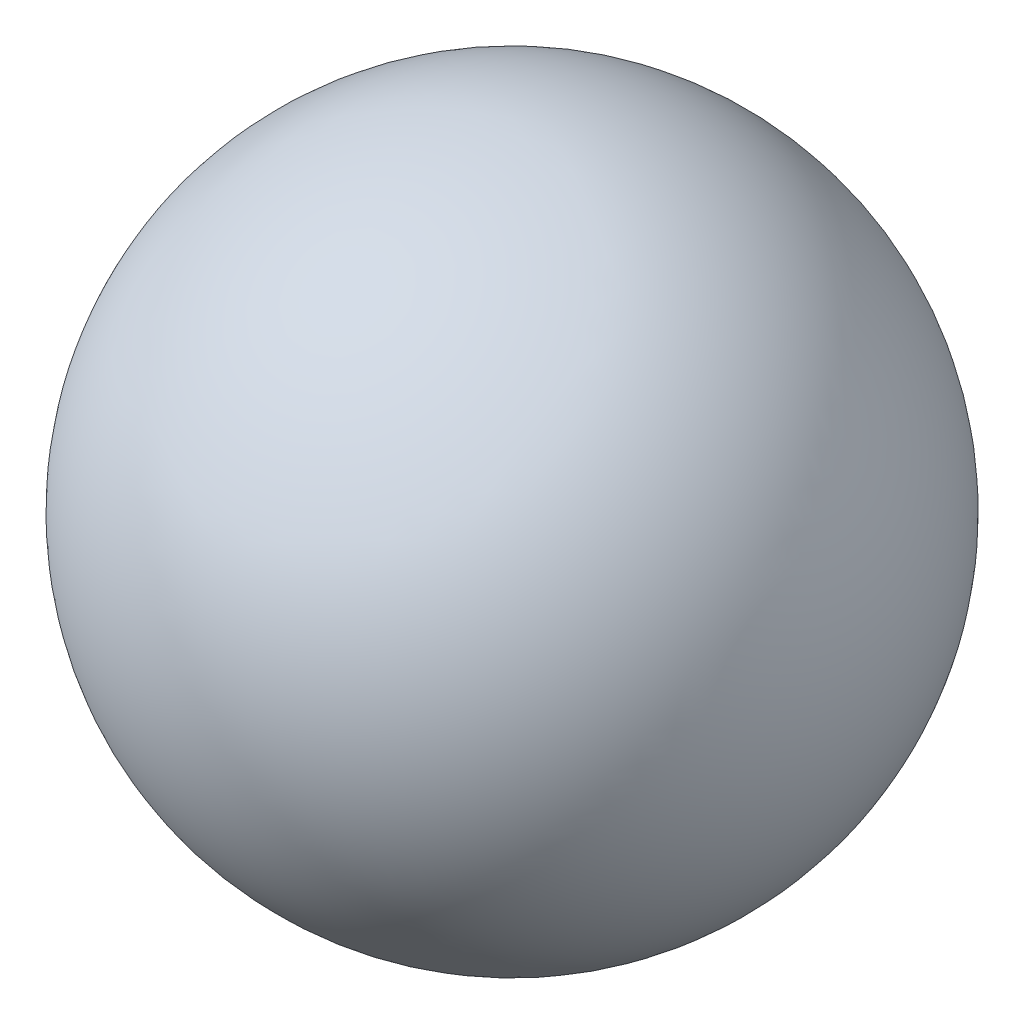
from build123d import *


with BuildPart() as part:
    # Sketch1 → Revolve1 (revolve)
    with BuildSketch(Plane.XY):
        with BuildLine():
            Line((5.5, 0), (-5.5, 0))
            ThreePointArc((-5.5, 0), (0, 5.5), (5.5, 0))
        make_face()
    revolve(axis=Axis((5.5, 0, 0), (-1, 0, 0)))


solid = part.part
